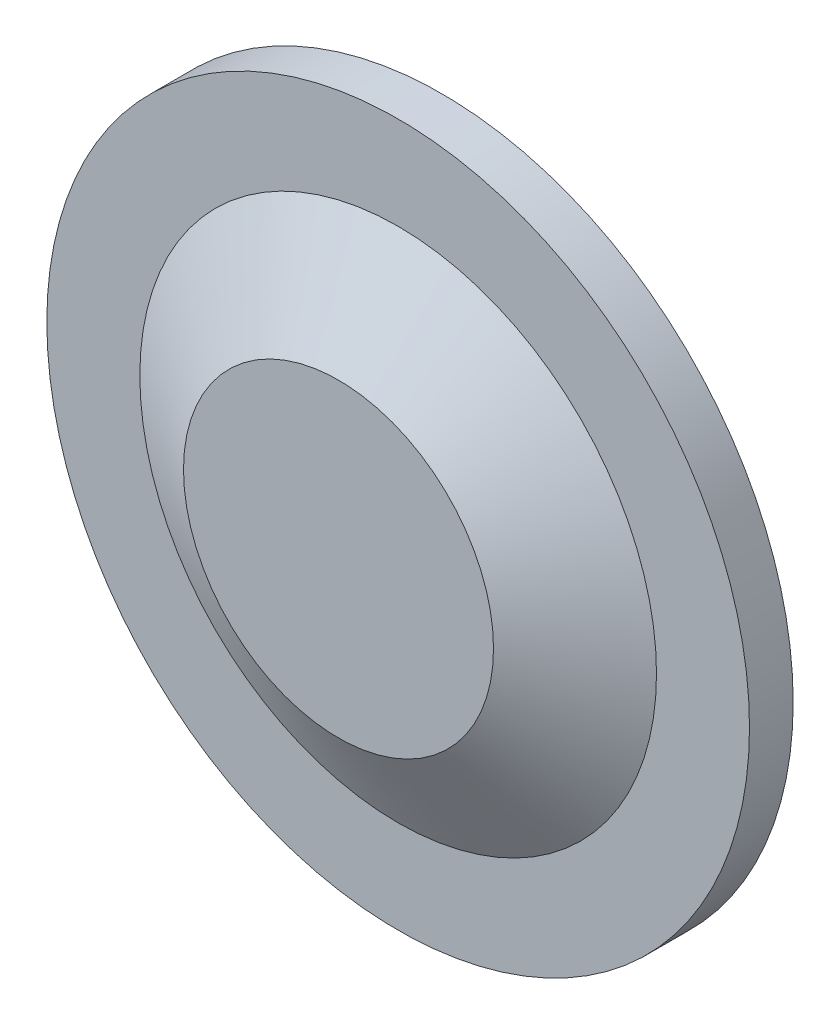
from build123d import *


with BuildPart() as part:
    # Sketch2 → Revolve1 (revolve)
    with BuildSketch(Plane(origin=(0, 0, 0), x_dir=(1, 0, 0), z_dir=(0, 1, 0)), mode=Mode.PRIVATE) as revolve1_sk:
        Polygon((0, 0), (850, 0), (850, -105.662432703), (625, -105.662432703), (375, -250), (0, -250), align=None)
    revolve(revolve1_sk.sketch.rotate(Axis((0, 0, 0), (0, 0, 1)), 180), axis=Axis((0, 0, 0), (0, 0, 1)))


solid = part.part
